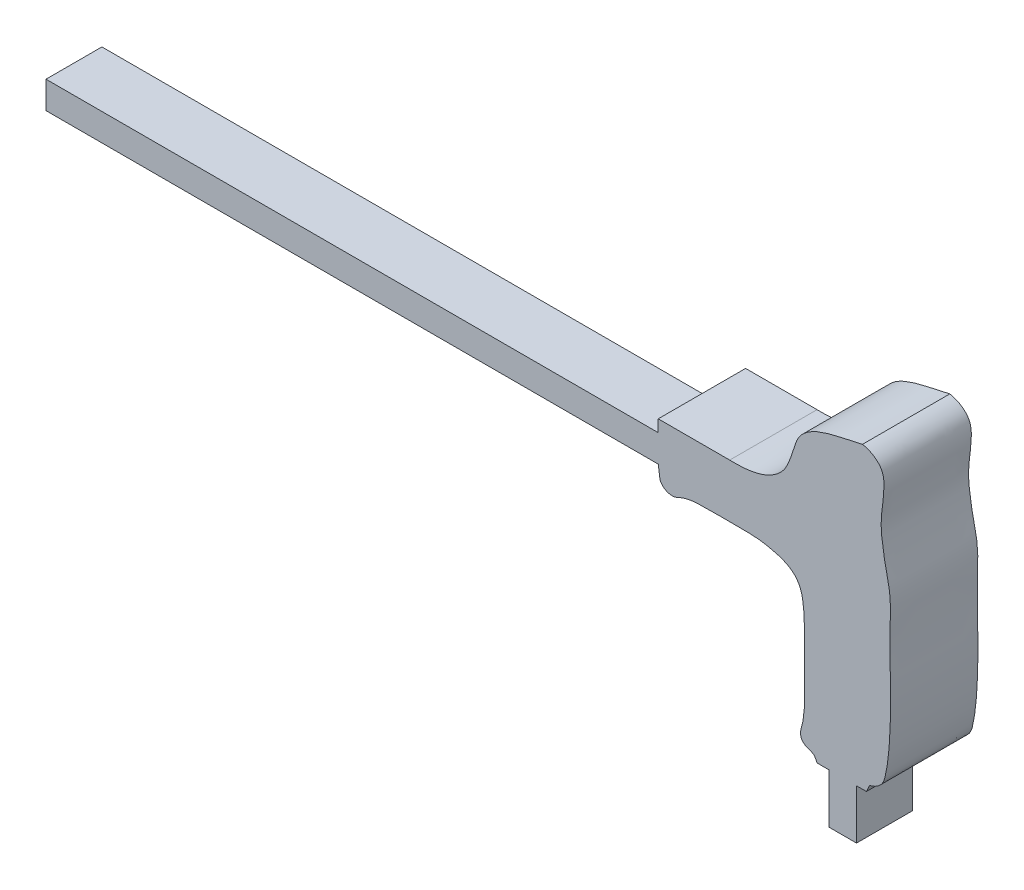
from build123d import *

# Parameters (mm, degrees)
BOSS_EXTRU_1_DEPTH      = 12.5
BOSS_EXTRU_1_DEPTH_BACK = 12.5
ESQUISSE2_W             = 175.243375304
ESQUISSE2_H             = 7.80312681
ESQUISSE2_W_2           = 7.918254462
ESQUISSE2_H_2           = 14.212251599
ENL_V_MAT_EXTRU_1_DEPTH = 9


with BuildPart() as part:
    # Esquisse1 → Boss.-Extru.1 (new, two sides: drawn at the far end of the back side and taken through both)
    with BuildSketch(Plane.XY.offset(-BOSS_EXTRU_1_DEPTH_BACK)):
        with BuildLine():
            Line((187.756618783, 81.054454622), (12.513243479, 81.054454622))
            Line((12.513243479, 81.054454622), (12.513243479, 73.251327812))
            Line((12.513243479, 73.251327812), (187.756618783, 73.251327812))
            Line((187.756618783, 73.251327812), (188.17604604, 70.257674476))
            add(Edge.make_bspline(
                [(232.3340013, 23.519268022), (231.338572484, 24.060331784), (228.985060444, 24.432114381), (228.269217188, 27.332887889), (229.014349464, 29.244699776), (229.417889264, 31.652056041), (229.693632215, 34.554411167), (229.577241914, 39.197082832), (229.513097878, 45.604942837), (229.681834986, 52.537027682), (229.443582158, 58.509761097), (228.744451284, 62.740059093), (226.2003551, 66.43959886), (221.632048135, 68.165786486), (216.831235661, 69.080052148), (211.662558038, 69.224980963), (206.505428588, 69.239765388), (201.594079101, 69.158452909), (197.556051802, 69.122937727), (194.782549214, 68.505781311), (192.409481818, 67.267913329), (189.78757591, 67.476393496), (188.246119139, 69.075305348), (188.17604604, 70.257674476)],
                knots=[0, 0, 0, 0, 0.045083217, 0.064595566, 0.096053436, 0.115650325, 0.15020725, 0.198103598, 0.27837372, 0.375116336, 0.44094216, 0.488641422, 0.522958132, 0.59324031, 0.651038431, 0.695470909, 0.773937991, 0.832170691, 0.867704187, 0.91561788, 0.929897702, 0.960953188, 1, 1, 1, 1], degree=3))
            Line((232.3340013, 23.519268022), (233.277358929, 21.903296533))
            Line((233.277358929, 21.903296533), (236.593550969, 21.903296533))
            Line((236.593550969, 21.903296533), (236.593550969, 7.691044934))
            Line((236.593550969, 7.691044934), (244.511805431, 7.691044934))
            Line((244.511805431, 7.691044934), (244.511805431, 21.903296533))
            Line((244.511805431, 21.903296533), (247.354255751, 21.903296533))
            Line((247.354255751, 21.903296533), (248.209058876, 23.828669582))
            add(Edge.make_bspline(
                [(246.214700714, 107.391044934), (248.410956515, 107.015595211), (251.625425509, 105.185535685), (252.488193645, 101.030567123), (252.3045169, 98.183496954), (251.934884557, 94.744398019), (251.233244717, 89.636254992), (252.088666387, 84.742297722), (252.854498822, 79.86649514), (253.730005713, 76.751003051), (254.310641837, 72.270674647), (254.176916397, 66.934427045), (253.992303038, 60.154473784), (254.311303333, 52.867808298), (254.277552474, 44.194317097), (253.974148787, 36.206818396), (253.144765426, 29.873352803), (252.052302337, 25.473028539), (249.528364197, 24.154001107), (248.209058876, 23.828669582)],
                knots=[0, 0, 0, 0, 0.079293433, 0.101283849, 0.139636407, 0.174758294, 0.21768437, 0.31209946, 0.339307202, 0.383647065, 0.420531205, 0.490628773, 0.56257969, 0.648485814, 0.73542104, 0.854353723, 0.915261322, 0.952730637, 1, 1, 1, 1], degree=3))
            add(Edge.make_bspline(
                [(208.214218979, 84.48559974), (211.910604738, 84.398554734), (217.913923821, 84.77188556), (223.407073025, 88.918345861), (225.437634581, 92.908089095), (226.478322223, 96.201495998), (227.725149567, 100.180588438), (230.665661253, 102.945720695), (236.917253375, 105.685804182), (242.375727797, 106.412295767), (246.214700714, 107.391044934)],
                knots=[0, 0, 0, 0, 0.233325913, 0.360352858, 0.405105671, 0.510696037, 0.576632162, 0.661455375, 0.751600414, 1, 1, 1, 1], degree=3))
            Line((208.214218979, 84.48559974), (187.756618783, 84.48559974))
            Line((187.756618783, 84.48559974), (187.756618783, 81.054454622))
        make_face()
    extrude(amount=BOSS_EXTRU_1_DEPTH + BOSS_EXTRU_1_DEPTH_BACK)

    # Esquisse2 → Enl_v. mat.-Extru.1 (cut)
    with BuildSketch(Plane(origin=(0, 0, -12.5), x_dir=(-1, 0, 0), z_dir=(0, 0, -1))):
        with Locations((-100.134931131, 77.152891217)):
            Rectangle(ESQUISSE2_W, ESQUISSE2_H)
        with Locations((-240.5526782, 14.797170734)):
            Rectangle(ESQUISSE2_W_2, ESQUISSE2_H_2)
    extrude(amount=-ENL_V_MAT_EXTRU_1_DEPTH, mode=Mode.SUBTRACT)


solid = part.part
